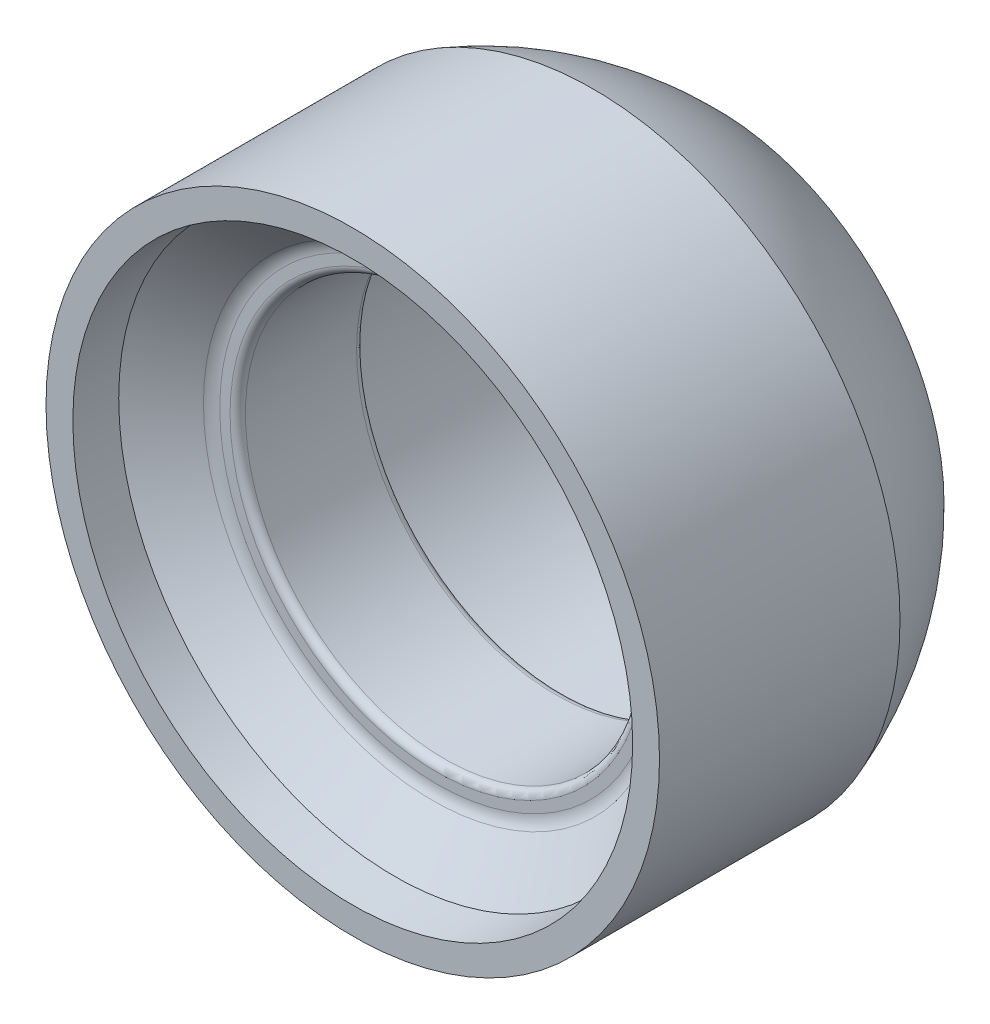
from build123d import *

# Parameters (mm, degrees)
VERRUNDUNG1_R = 0.2
VERRUNDUNG2_R = 0.5


with BuildPart() as part:
    # Skizze1 → Rotation1 (revolve)
    with BuildSketch(Plane(origin=(0, 0, 0), x_dir=(1, 0, 0), z_dir=(0, 1, 0))):
        with BuildLine():
            Line((7.3, 0), (8, 0))
            Line((8, 0), (8, 6.272281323))
            ThreePointArc((8, 6.272281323), (7.144394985, 8.00517321), (5.919459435, 9.5))
            Line((5.919459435, 9.5), (5.75, 9.5))
            Line((5.75, 9.5), (5.75, 5.5))
            Line((5.75, 5.5), (5.2, 5.5))
            Line((5.2, 5.5), (5.2, 2.2))
            Line((5.2, 2.2), (5.845375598, 2.2))
            Line((5.845375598, 2.2), (7.20376247, 1.1))
            Line((7.20376247, 1.1), (7.3, 0))
        make_face()
    revolve(axis=Axis((0, 0, 0), (0, 0, -1)))

    # Verrundung1
    verrundung1_edges = [part.edges().sort_by_distance(p)[0] for p in [
        (-5.2, 0, -2.2),
        (-5.2, 0, -5.5),
        (-5.75, 0, -5.5),
    ]]
    fillet(verrundung1_edges, radius=VERRUNDUNG1_R)

    # Verrundung2
    verrundung2_edges = [part.edges().sort_by_distance(p)[0] for p in [
        (-5.845375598, 0, -2.2),
    ]]
    fillet(verrundung2_edges, radius=VERRUNDUNG2_R)


solid = part.part
